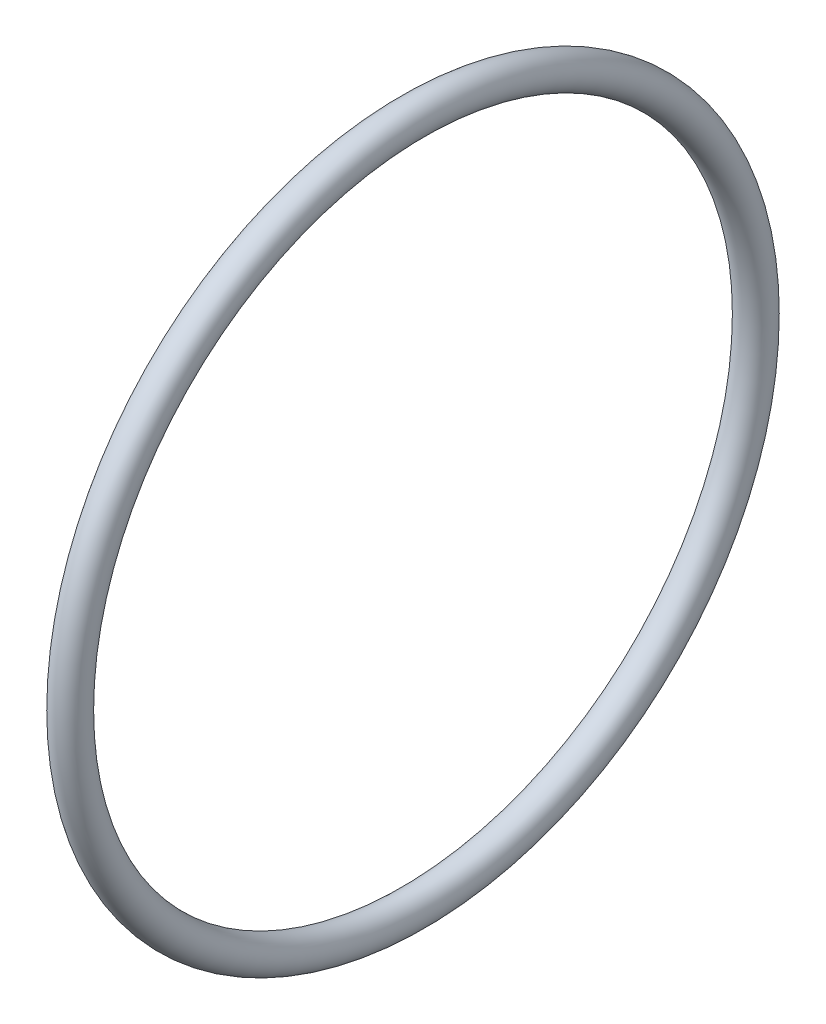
from build123d import *

# Parameters (mm, degrees)
ESQUISSE1_R = 3


with BuildPart() as part:
    # Esquisse1 → Base-R_volution (revolve)
    with BuildSketch(Plane.XY, mode=Mode.PRIVATE) as base_r_volution_sk:
        with Locations((-3, 62)):
            Circle(ESQUISSE1_R)
    revolve(base_r_volution_sk.sketch.rotate(Axis((60, 0, 0), (-1, 0, 0)), 90), axis=Axis((60, 0, 0), (-1, 0, 0)))


solid = part.part
